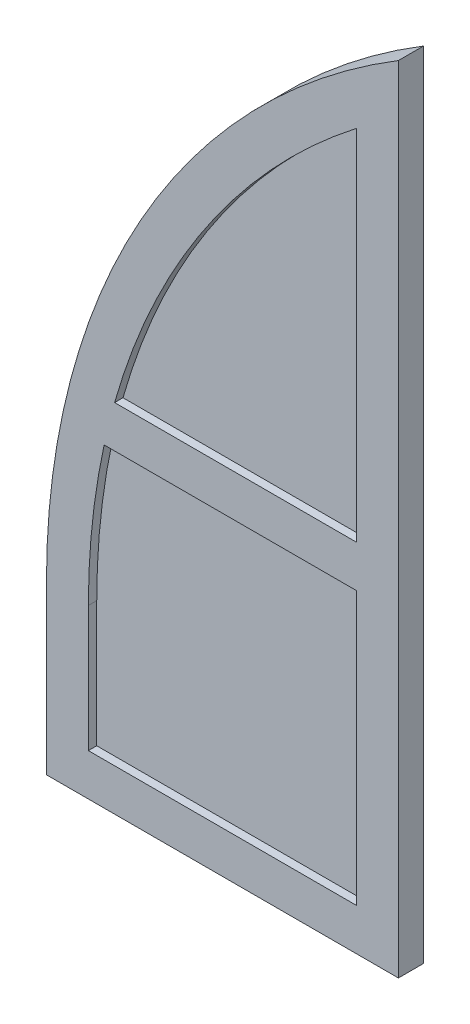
ISO-10303-21;
HEADER;
FILE_DESCRIPTION(('STEP AP214'),'2;1');
FILE_NAME('part.step','',(''),(''),'','','');
FILE_SCHEMA(('AUTOMOTIVE_DESIGN { 1 0 10303 214 1 1 1 1 }'));
ENDSEC;
DATA;
#1=APPLICATION_CONTEXT('core data for automotive mechanical design processes');
#2=APPLICATION_PROTOCOL_DEFINITION('international standard','automotive_design',2000,#1);
#3=PRODUCT_CONTEXT('',#1,'mechanical');
#4=PRODUCT('Part','Part','',(#3));
#5=PRODUCT_RELATED_PRODUCT_CATEGORY('part','',(#4));
#6=PRODUCT_DEFINITION_FORMATION('','',#4);
#7=PRODUCT_DEFINITION_CONTEXT('part definition',#1,'design');
#8=PRODUCT_DEFINITION('design','',#6,#7);
#9=PRODUCT_DEFINITION_SHAPE('','',#8);
#10=(LENGTH_UNIT() NAMED_UNIT(*) SI_UNIT(.MILLI.,.METRE.));
#11=(NAMED_UNIT(*) PLANE_ANGLE_UNIT() SI_UNIT($,.RADIAN.));
#12=(NAMED_UNIT(*) SI_UNIT($,.STERADIAN.) SOLID_ANGLE_UNIT());
#13=UNCERTAINTY_MEASURE_WITH_UNIT(LENGTH_MEASURE(1.E-05),#10,'distance_accuracy_value','');
#14=(GEOMETRIC_REPRESENTATION_CONTEXT(3) GLOBAL_UNCERTAINTY_ASSIGNED_CONTEXT((#13)) GLOBAL_UNIT_ASSIGNED_CONTEXT((#10,
#11,#12)) REPRESENTATION_CONTEXT('',''));
#15=CARTESIAN_POINT('',(0.,0.,0.));
#16=DIRECTION('',(0.,0.,1.));
#17=DIRECTION('',(1.,0.,0.));
#18=AXIS2_PLACEMENT_3D('',#15,#16,#17);
#19=CARTESIAN_POINT('',(1348.58140528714,-601.868682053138,10.));
#20=DIRECTION('',(0.,0.,-1.));
#21=DIRECTION('',(-1.,0.,0.));
#22=AXIS2_PLACEMENT_3D('',#19,#20,#21);
#23=CYLINDRICAL_SURFACE('',#22,1653.03652149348);
#24=DIRECTION('',(0.,0.,-1.));
#25=VECTOR('',#24,1.);
#26=CARTESIAN_POINT('',(-265.607331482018,-245.604084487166,10.));
#27=LINE('',#26,#25);
#28=CARTESIAN_POINT('',(-265.607331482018,-245.604084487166,10.));
#29=VERTEX_POINT('',#28);
#30=CARTESIAN_POINT('',(-265.607331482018,-245.604084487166,0.));
#31=VERTEX_POINT('',#30);
#32=EDGE_CURVE('E174',#29,#31,#27,.T.);
#33=ORIENTED_EDGE('',*,*,#32,.F.);
#34=CARTESIAN_POINT('',(1348.58140528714,-601.868682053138,10.));
#35=DIRECTION('',(0.,0.,-1.));
#36=DIRECTION('',(-1.,0.,0.));
#37=AXIS2_PLACEMENT_3D('',#34,#35,#36);
#38=CIRCLE('',#37,1653.03652149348);
#39=CARTESIAN_POINT('',(-304.455116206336,-601.868682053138,10.));
#40=VERTEX_POINT('',#39);
#41=EDGE_CURVE('E418',#40,#29,#38,.T.);
#42=ORIENTED_EDGE('',*,*,#41,.F.);
#43=DIRECTION('',(0.,0.,-1.));
#44=VECTOR('',#43,1.);
#45=CARTESIAN_POINT('',(-304.455116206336,-601.868682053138,10.));
#46=LINE('',#45,#44);
#47=CARTESIAN_POINT('',(-304.455116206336,-601.868682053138,0.));
#48=VERTEX_POINT('',#47);
#49=EDGE_CURVE('E208',#40,#48,#46,.T.);
#50=ORIENTED_EDGE('',*,*,#49,.T.);
#51=CARTESIAN_POINT('',(1348.58140528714,-601.868682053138,0.));
#52=DIRECTION('',(0.,0.,-1.));
#53=DIRECTION('',(-1.,0.,0.));
#54=AXIS2_PLACEMENT_3D('',#51,#52,#53);
#55=CIRCLE('',#54,1653.03652149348);
#56=EDGE_CURVE('E197',#48,#31,#55,.T.);
#57=ORIENTED_EDGE('',*,*,#56,.T.);
#58=EDGE_LOOP('',(#33,#42,#50,#57));
#59=FACE_BOUND('',#58,.T.);
#60=ADVANCED_FACE('F32',(#59),#23,.F.);
#61=DIRECTION('',(0.,0.,-1.));
#62=VECTOR('',#61,1.);
#63=CARTESIAN_POINT('',(-240.239653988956,-145.604084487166,10.));
#64=LINE('',#63,#62);
#65=CARTESIAN_POINT('',(-240.239653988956,-145.604084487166,0.));
#66=VERTEX_POINT('',#65);
#67=CARTESIAN_POINT('',(-240.239653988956,-145.604084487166,10.));
#68=VERTEX_POINT('',#67);
#69=EDGE_CURVE('E47',#66,#68,#64,.F.);
#70=ORIENTED_EDGE('',*,*,#69,.F.);
#71=CARTESIAN_POINT('',(335.544883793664,704.38043182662,0.));
#72=VERTEX_POINT('',#71);
#73=EDGE_CURVE('E53',#66,#72,#55,.T.);
#74=ORIENTED_EDGE('',*,*,#73,.T.);
#75=DIRECTION('',(0.,0.,-1.));
#76=VECTOR('',#75,1.);
#77=CARTESIAN_POINT('',(335.544883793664,704.38043182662,10.));
#78=LINE('',#77,#76);
#79=CARTESIAN_POINT('',(335.544883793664,704.38043182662,10.));
#80=VERTEX_POINT('',#79);
#81=EDGE_CURVE('E215',#80,#72,#78,.T.);
#82=ORIENTED_EDGE('',*,*,#81,.F.);
#83=EDGE_CURVE('E207',#68,#80,#38,.T.);
#84=ORIENTED_EDGE('',*,*,#83,.F.);
#85=EDGE_LOOP('',(#70,#74,#82,#84));
#86=FACE_BOUND('',#85,.T.);
#87=ADVANCED_FACE('F338',(#86),#23,.F.);
#88=CARTESIAN_POINT('',(335.544883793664,704.38043182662,10.));
#89=DIRECTION('',(1.,0.,0.));
#90=DIRECTION('',(0.,0.,-1.));
#91=AXIS2_PLACEMENT_3D('',#88,#89,#90);
#92=PLANE('',#91);
#93=DIRECTION('',(0.,0.,1.));
#94=VECTOR('',#93,1.);
#95=CARTESIAN_POINT('',(335.544883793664,-245.604084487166,0.));
#96=LINE('',#95,#94);
#97=CARTESIAN_POINT('',(335.544883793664,-245.604084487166,0.));
#98=VERTEX_POINT('',#97);
#99=CARTESIAN_POINT('',(335.544883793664,-245.604084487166,10.));
#100=VERTEX_POINT('',#99);
#101=EDGE_CURVE('E171',#98,#100,#96,.T.);
#102=ORIENTED_EDGE('',*,*,#101,.F.);
#103=DIRECTION('',(0.,-1.,0.));
#104=VECTOR('',#103,1.);
#105=CARTESIAN_POINT('',(335.544883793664,704.38043182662,0.));
#106=LINE('',#105,#104);
#107=CARTESIAN_POINT('',(335.544883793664,-901.868682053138,0.));
#108=VERTEX_POINT('',#107);
#109=EDGE_CURVE('E186',#98,#108,#106,.T.);
#110=ORIENTED_EDGE('',*,*,#109,.T.);
#111=DIRECTION('',(0.,0.,-1.));
#112=VECTOR('',#111,1.);
#113=CARTESIAN_POINT('',(335.544883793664,-901.868682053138,10.));
#114=LINE('',#113,#112);
#115=CARTESIAN_POINT('',(335.544883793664,-901.868682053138,10.));
#116=VERTEX_POINT('',#115);
#117=EDGE_CURVE('E213',#116,#108,#114,.T.);
#118=ORIENTED_EDGE('',*,*,#117,.F.);
#119=DIRECTION('',(0.,-1.,0.));
#120=VECTOR('',#119,1.);
#121=CARTESIAN_POINT('',(335.544883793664,704.38043182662,10.));
#122=LINE('',#121,#120);
#123=EDGE_CURVE('E188',#100,#116,#122,.T.);
#124=ORIENTED_EDGE('',*,*,#123,.F.);
#125=EDGE_LOOP('',(#102,#110,#118,#124));
#126=FACE_BOUND('',#125,.T.);
#127=ADVANCED_FACE('F184',(#126),#92,.F.);
#128=DIRECTION('',(0.,0.,1.));
#129=VECTOR('',#128,1.);
#130=CARTESIAN_POINT('',(335.544883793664,-145.604084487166,0.));
#131=LINE('',#130,#129);
#132=CARTESIAN_POINT('',(335.544883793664,-145.604084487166,0.));
#133=VERTEX_POINT('',#132);
#134=CARTESIAN_POINT('',(335.544883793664,-145.604084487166,10.));
#135=VERTEX_POINT('',#134);
#136=EDGE_CURVE('E189',#133,#135,#131,.T.);
#137=ORIENTED_EDGE('',*,*,#136,.T.);
#138=EDGE_CURVE('E414',#80,#135,#122,.T.);
#139=ORIENTED_EDGE('',*,*,#138,.F.);
#140=ORIENTED_EDGE('',*,*,#81,.T.);
#141=EDGE_CURVE('E196',#72,#133,#106,.T.);
#142=ORIENTED_EDGE('',*,*,#141,.T.);
#143=EDGE_LOOP('',(#137,#139,#140,#142));
#144=FACE_BOUND('',#143,.T.);
#145=ADVANCED_FACE('F392',(#144),#92,.F.);
#146=CARTESIAN_POINT('',(1348.58140528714,-601.868682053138,10.));
#147=DIRECTION('',(0.,0.,-1.));
#148=DIRECTION('',(-1.,0.,0.));
#149=AXIS2_PLACEMENT_3D('',#146,#147,#148);
#150=PLANE('',#149);
#151=ORIENTED_EDGE('',*,*,#41,.T.);
#152=DIRECTION('',(-1.,0.,0.));
#153=VECTOR('',#152,1.);
#154=CARTESIAN_POINT('',(335.544883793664,-245.604084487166,10.));
#155=LINE('',#154,#153);
#156=EDGE_CURVE('E180',#100,#29,#155,.T.);
#157=ORIENTED_EDGE('',*,*,#156,.F.);
#158=ORIENTED_EDGE('',*,*,#123,.T.);
#159=DIRECTION('',(-1.,0.,0.));
#160=VECTOR('',#159,1.);
#161=CARTESIAN_POINT('',(335.544883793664,-901.868682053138,10.));
#162=LINE('',#161,#160);
#163=CARTESIAN_POINT('',(-304.455116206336,-901.868682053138,10.));
#164=VERTEX_POINT('',#163);
#165=EDGE_CURVE('E413',#116,#164,#162,.T.);
#166=ORIENTED_EDGE('',*,*,#165,.T.);
#167=DIRECTION('',(0.,1.,0.));
#168=VECTOR('',#167,1.);
#169=CARTESIAN_POINT('',(-304.455116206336,-901.868682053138,10.));
#170=LINE('',#169,#168);
#171=EDGE_CURVE('E217',#164,#40,#170,.T.);
#172=ORIENTED_EDGE('',*,*,#171,.T.);
#173=EDGE_LOOP('',(#151,#157,#158,#166,#172));
#174=FACE_BOUND('',#173,.T.);
#175=ADVANCED_FACE('F386',(#174),#150,.T.);
#176=ORIENTED_EDGE('',*,*,#138,.T.);
#177=DIRECTION('',(-1.,0.,0.));
#178=VECTOR('',#177,1.);
#179=CARTESIAN_POINT('',(1348.58140528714,-145.604084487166,10.));
#180=LINE('',#179,#178);
#181=EDGE_CURVE('E11',#135,#68,#180,.T.);
#182=ORIENTED_EDGE('',*,*,#181,.T.);
#183=ORIENTED_EDGE('',*,*,#83,.T.);
#184=EDGE_LOOP('',(#176,#182,#183));
#185=FACE_BOUND('',#184,.T.);
#186=ADVANCED_FACE('F382',(#185),#150,.T.);
#187=CARTESIAN_POINT('',(0.,0.,40.));
#188=DIRECTION('',(0.,0.,1.));
#189=DIRECTION('',(1.,0.,0.));
#190=AXIS2_PLACEMENT_3D('',#187,#188,#189);
#191=PLANE('',#190);
#192=CARTESIAN_POINT('',(1348.58140528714,-601.868682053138,40.));
#193=DIRECTION('',(0.,0.,1.));
#194=DIRECTION('',(1.,0.,0.));
#195=AXIS2_PLACEMENT_3D('',#192,#193,#194);
#196=CIRCLE('',#195,1653.03652149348);
#197=CARTESIAN_POINT('',(-241.815699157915,-151.128411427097,40.));
#198=VERTEX_POINT('',#197);
#199=CARTESIAN_POINT('',(335.544883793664,704.38043182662,40.));
#200=VERTEX_POINT('',#199);
#201=EDGE_CURVE('E283',#198,#200,#196,.F.);
#202=ORIENTED_EDGE('',*,*,#201,.F.);
#203=DIRECTION('',(-1.,0.,0.));
#204=VECTOR('',#203,1.);
#205=CARTESIAN_POINT('',(0.,-151.128411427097,40.));
#206=LINE('',#205,#204);
#207=CARTESIAN_POINT('',(335.544883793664,-151.128411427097,40.));
#208=VERTEX_POINT('',#207);
#209=EDGE_CURVE('E307',#208,#198,#206,.T.);
#210=ORIENTED_EDGE('',*,*,#209,.F.);
#211=DIRECTION('',(0.,1.,0.));
#212=VECTOR('',#211,1.);
#213=CARTESIAN_POINT('',(335.544883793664,0.,40.));
#214=LINE('',#213,#212);
#215=EDGE_CURVE('E40',#208,#200,#214,.T.);
#216=ORIENTED_EDGE('',*,*,#215,.T.);
#217=EDGE_LOOP('',(#202,#210,#216));
#218=FACE_BOUND('',#217,.T.);
#219=ADVANCED_FACE('F312',(#218),#191,.T.);
#220=CARTESIAN_POINT('',(0.,-151.128411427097,60.));
#221=DIRECTION('',(0.,-1.,0.));
#222=DIRECTION('',(0.,0.,-1.));
#223=AXIS2_PLACEMENT_3D('',#220,#221,#222);
#224=PLANE('',#223);
#225=ORIENTED_EDGE('',*,*,#209,.T.);
#226=DIRECTION('',(0.,0.,-1.));
#227=VECTOR('',#226,1.);
#228=CARTESIAN_POINT('',(-241.815699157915,-151.128411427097,60.));
#229=LINE('',#228,#227);
#230=CARTESIAN_POINT('',(-241.815699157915,-151.128411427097,60.));
#231=VERTEX_POINT('',#230);
#232=EDGE_CURVE('E280',#231,#198,#229,.T.);
#233=ORIENTED_EDGE('',*,*,#232,.F.);
#234=DIRECTION('',(-1.,0.,0.));
#235=VECTOR('',#234,1.);
#236=CARTESIAN_POINT('',(0.,-151.128411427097,60.));
#237=LINE('',#236,#235);
#238=CARTESIAN_POINT('',(335.544883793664,-151.128411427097,60.));
#239=VERTEX_POINT('',#238);
#240=EDGE_CURVE('E256',#239,#231,#237,.T.);
#241=ORIENTED_EDGE('',*,*,#240,.F.);
#242=DIRECTION('',(0.,0.,-1.));
#243=VECTOR('',#242,1.);
#244=CARTESIAN_POINT('',(335.544883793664,-151.128411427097,60.));
#245=LINE('',#244,#243);
#246=EDGE_CURVE('E274',#239,#208,#245,.T.);
#247=ORIENTED_EDGE('',*,*,#246,.T.);
#248=EDGE_LOOP('',(#225,#233,#241,#247));
#249=FACE_BOUND('',#248,.T.);
#250=ADVANCED_FACE('F318',(#249),#224,.F.);
#251=CARTESIAN_POINT('',(1348.58140528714,-601.868682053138,60.));
#252=DIRECTION('',(0.,0.,-1.));
#253=DIRECTION('',(-1.,0.,0.));
#254=AXIS2_PLACEMENT_3D('',#251,#252,#253);
#255=CYLINDRICAL_SURFACE('',#254,1653.03652149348);
#256=ORIENTED_EDGE('',*,*,#201,.T.);
#257=DIRECTION('',(0.,0.,-1.));
#258=VECTOR('',#257,1.);
#259=CARTESIAN_POINT('',(335.544883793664,704.38043182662,60.));
#260=LINE('',#259,#258);
#261=CARTESIAN_POINT('',(335.544883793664,704.38043182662,60.));
#262=VERTEX_POINT('',#261);
#263=EDGE_CURVE('E277',#262,#200,#260,.T.);
#264=ORIENTED_EDGE('',*,*,#263,.F.);
#265=CARTESIAN_POINT('',(1348.58140528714,-601.868682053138,60.));
#266=DIRECTION('',(0.,0.,1.));
#267=DIRECTION('',(1.,0.,0.));
#268=AXIS2_PLACEMENT_3D('',#265,#266,#267);
#269=CIRCLE('',#268,1653.03652149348);
#270=EDGE_CURVE('E259',#231,#262,#269,.F.);
#271=ORIENTED_EDGE('',*,*,#270,.F.);
#272=ORIENTED_EDGE('',*,*,#232,.T.);
#273=EDGE_LOOP('',(#256,#264,#271,#272));
#274=FACE_BOUND('',#273,.T.);
#275=ADVANCED_FACE('F324',(#274),#255,.F.);
#276=CARTESIAN_POINT('',(-304.455116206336,0.,60.));
#277=DIRECTION('',(-1.,0.,0.));
#278=DIRECTION('',(0.,0.,1.));
#279=AXIS2_PLACEMENT_3D('',#276,#277,#278);
#280=PLANE('',#279);
#281=DIRECTION('',(0.,0.,-1.));
#282=VECTOR('',#281,1.);
#283=CARTESIAN_POINT('',(-304.455116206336,-901.868682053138,60.));
#284=LINE('',#283,#282);
#285=CARTESIAN_POINT('',(-304.455116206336,-901.868682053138,60.));
#286=VERTEX_POINT('',#285);
#287=CARTESIAN_POINT('',(-304.455116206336,-901.868682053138,40.));
#288=VERTEX_POINT('',#287);
#289=EDGE_CURVE('E284',#286,#288,#284,.T.);
#290=ORIENTED_EDGE('',*,*,#289,.T.);
#291=DIRECTION('',(0.,1.,0.));
#292=VECTOR('',#291,1.);
#293=CARTESIAN_POINT('',(-304.455116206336,0.,40.));
#294=LINE('',#293,#292);
#295=CARTESIAN_POINT('',(-304.455116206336,-601.868682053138,40.));
#296=VERTEX_POINT('',#295);
#297=EDGE_CURVE('E219',#288,#296,#294,.T.);
#298=ORIENTED_EDGE('',*,*,#297,.T.);
#299=DIRECTION('',(0.,0.,-1.));
#300=VECTOR('',#299,1.);
#301=CARTESIAN_POINT('',(-304.455116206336,-601.868682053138,60.));
#302=LINE('',#301,#300);
#303=CARTESIAN_POINT('',(-304.455116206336,-601.868682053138,60.));
#304=VERTEX_POINT('',#303);
#305=EDGE_CURVE('E278',#304,#296,#302,.T.);
#306=ORIENTED_EDGE('',*,*,#305,.F.);
#307=DIRECTION('',(0.,1.,0.));
#308=VECTOR('',#307,1.);
#309=CARTESIAN_POINT('',(-304.455116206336,0.,60.));
#310=LINE('',#309,#308);
#311=EDGE_CURVE('E242',#286,#304,#310,.T.);
#312=ORIENTED_EDGE('',*,*,#311,.F.);
#313=EDGE_LOOP('',(#290,#298,#306,#312));
#314=FACE_BOUND('',#313,.T.);
#315=ADVANCED_FACE('F326',(#314),#280,.F.);
#316=CARTESIAN_POINT('',(1348.58140528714,-601.868682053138,60.));
#317=DIRECTION('',(0.,0.,-1.));
#318=DIRECTION('',(-1.,0.,0.));
#319=AXIS2_PLACEMENT_3D('',#316,#317,#318);
#320=CYLINDRICAL_SURFACE('',#319,1653.03652149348);
#321=ORIENTED_EDGE('',*,*,#305,.T.);
#322=CARTESIAN_POINT('',(1348.58140528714,-601.868682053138,40.));
#323=DIRECTION('',(0.,0.,1.));
#324=DIRECTION('',(1.,0.,0.));
#325=AXIS2_PLACEMENT_3D('',#322,#323,#324);
#326=CIRCLE('',#325,1653.03652149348);
#327=CARTESIAN_POINT('',(-266.816689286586,-251.128411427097,40.));
#328=VERTEX_POINT('',#327);
#329=EDGE_CURVE('E210',#296,#328,#326,.F.);
#330=ORIENTED_EDGE('',*,*,#329,.T.);
#331=DIRECTION('',(0.,0.,-1.));
#332=VECTOR('',#331,1.);
#333=CARTESIAN_POINT('',(-266.816689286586,-251.128411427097,60.));
#334=LINE('',#333,#332);
#335=CARTESIAN_POINT('',(-266.816689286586,-251.128411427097,60.));
#336=VERTEX_POINT('',#335);
#337=EDGE_CURVE('E293',#336,#328,#334,.T.);
#338=ORIENTED_EDGE('',*,*,#337,.F.);
#339=CARTESIAN_POINT('',(1348.58140528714,-601.868682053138,60.));
#340=DIRECTION('',(0.,0.,1.));
#341=DIRECTION('',(1.,0.,0.));
#342=AXIS2_PLACEMENT_3D('',#339,#340,#341);
#343=CIRCLE('',#342,1653.03652149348);
#344=EDGE_CURVE('E245',#304,#336,#343,.F.);
#345=ORIENTED_EDGE('',*,*,#344,.F.);
#346=EDGE_LOOP('',(#321,#330,#338,#345));
#347=FACE_BOUND('',#346,.T.);
#348=ADVANCED_FACE('F332',(#347),#320,.F.);
#349=CARTESIAN_POINT('',(0.,-251.128411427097,60.));
#350=DIRECTION('',(0.,-1.,0.));
#351=DIRECTION('',(1.,0.,0.));
#352=AXIS2_PLACEMENT_3D('',#349,#350,#351);
#353=PLANE('',#352);
#354=DIRECTION('',(-1.,0.,0.));
#355=VECTOR('',#354,1.);
#356=CARTESIAN_POINT('',(0.,-251.128411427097,40.));
#357=LINE('',#356,#355);
#358=CARTESIAN_POINT('',(335.544883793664,-251.128411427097,40.));
#359=VERTEX_POINT('',#358);
#360=EDGE_CURVE('E227',#359,#328,#357,.T.);
#361=ORIENTED_EDGE('',*,*,#360,.F.);
#362=DIRECTION('',(0.,0.,-1.));
#363=VECTOR('',#362,1.);
#364=CARTESIAN_POINT('',(335.544883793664,-251.128411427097,60.));
#365=LINE('',#364,#363);
#366=CARTESIAN_POINT('',(335.544883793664,-251.128411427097,60.));
#367=VERTEX_POINT('',#366);
#368=EDGE_CURVE('E290',#367,#359,#365,.T.);
#369=ORIENTED_EDGE('',*,*,#368,.F.);
#370=DIRECTION('',(-1.,0.,0.));
#371=VECTOR('',#370,1.);
#372=CARTESIAN_POINT('',(0.,-251.128411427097,60.));
#373=LINE('',#372,#371);
#374=EDGE_CURVE('E247',#367,#336,#373,.T.);
#375=ORIENTED_EDGE('',*,*,#374,.T.);
#376=ORIENTED_EDGE('',*,*,#337,.T.);
#377=EDGE_LOOP('',(#361,#369,#375,#376));
#378=FACE_BOUND('',#377,.T.);
#379=ADVANCED_FACE('F514',(#378),#353,.T.);
#380=CARTESIAN_POINT('',(335.544883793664,0.,60.));
#381=DIRECTION('',(-1.,0.,0.));
#382=DIRECTION('',(0.,-1.,0.));
#383=AXIS2_PLACEMENT_3D('',#380,#381,#382);
#384=PLANE('',#383);
#385=DIRECTION('',(0.,1.,0.));
#386=VECTOR('',#385,1.);
#387=CARTESIAN_POINT('',(335.544883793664,0.,40.));
#388=LINE('',#387,#386);
#389=CARTESIAN_POINT('',(335.544883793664,-901.868682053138,40.));
#390=VERTEX_POINT('',#389);
#391=EDGE_CURVE('E224',#390,#359,#388,.T.);
#392=ORIENTED_EDGE('',*,*,#391,.F.);
#393=DIRECTION('',(0.,0.,-1.));
#394=VECTOR('',#393,1.);
#395=CARTESIAN_POINT('',(335.544883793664,-901.868682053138,60.));
#396=LINE('',#395,#394);
#397=CARTESIAN_POINT('',(335.544883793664,-901.868682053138,60.));
#398=VERTEX_POINT('',#397);
#399=EDGE_CURVE('E287',#398,#390,#396,.T.);
#400=ORIENTED_EDGE('',*,*,#399,.F.);
#401=DIRECTION('',(0.,1.,0.));
#402=VECTOR('',#401,1.);
#403=CARTESIAN_POINT('',(335.544883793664,0.,60.));
#404=LINE('',#403,#402);
#405=EDGE_CURVE('E250',#398,#367,#404,.T.);
#406=ORIENTED_EDGE('',*,*,#405,.T.);
#407=ORIENTED_EDGE('',*,*,#368,.T.);
#408=EDGE_LOOP('',(#392,#400,#406,#407));
#409=FACE_BOUND('',#408,.T.);
#410=ADVANCED_FACE('F379',(#409),#384,.T.);
#411=CARTESIAN_POINT('',(1348.58140528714,-601.868682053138,60.));
#412=DIRECTION('',(0.,0.,-1.));
#413=DIRECTION('',(-1.,0.,0.));
#414=AXIS2_PLACEMENT_3D('',#411,#412,#413);
#415=CYLINDRICAL_SURFACE('',#414,1753.03652149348);
#416=CARTESIAN_POINT('',(1348.58140528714,-601.868682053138,0.));
#417=DIRECTION('',(0.,0.,1.));
#418=DIRECTION('',(1.,0.,0.));
#419=AXIS2_PLACEMENT_3D('',#416,#417,#418);
#420=CIRCLE('',#419,1753.03652149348);
#421=CARTESIAN_POINT('',(-404.455116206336,-601.868682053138,0.));
#422=VERTEX_POINT('',#421);
#423=CARTESIAN_POINT('',(435.544883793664,894.627678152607,0.));
#424=VERTEX_POINT('',#423);
#425=EDGE_CURVE('E230',#422,#424,#420,.F.);
#426=ORIENTED_EDGE('',*,*,#425,.F.);
#427=DIRECTION('',(0.,0.,-1.));
#428=VECTOR('',#427,1.);
#429=CARTESIAN_POINT('',(-404.455116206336,-601.868682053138,60.));
#430=LINE('',#429,#428);
#431=CARTESIAN_POINT('',(-404.455116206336,-601.868682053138,60.));
#432=VERTEX_POINT('',#431);
#433=EDGE_CURVE('E288',#432,#422,#430,.T.);
#434=ORIENTED_EDGE('',*,*,#433,.F.);
#435=CARTESIAN_POINT('',(1348.58140528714,-601.868682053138,60.));
#436=DIRECTION('',(0.,0.,1.));
#437=DIRECTION('',(1.,0.,0.));
#438=AXIS2_PLACEMENT_3D('',#435,#436,#437);
#439=CIRCLE('',#438,1753.03652149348);
#440=CARTESIAN_POINT('',(435.544883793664,894.627678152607,60.));
#441=VERTEX_POINT('',#440);
#442=EDGE_CURVE('E231',#432,#441,#439,.F.);
#443=ORIENTED_EDGE('',*,*,#442,.T.);
#444=DIRECTION('',(0.,0.,-1.));
#445=VECTOR('',#444,1.);
#446=CARTESIAN_POINT('',(435.544883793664,894.627678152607,60.));
#447=LINE('',#446,#445);
#448=EDGE_CURVE('E264',#441,#424,#447,.T.);
#449=ORIENTED_EDGE('',*,*,#448,.T.);
#450=EDGE_LOOP('',(#426,#434,#443,#449));
#451=FACE_BOUND('',#450,.T.);
#452=ADVANCED_FACE('F376',(#451),#415,.T.);
#453=CARTESIAN_POINT('',(-404.455116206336,0.,60.));
#454=DIRECTION('',(-1.,0.,0.));
#455=DIRECTION('',(0.,0.,1.));
#456=AXIS2_PLACEMENT_3D('',#453,#454,#455);
#457=PLANE('',#456);
#458=DIRECTION('',(0.,1.,0.));
#459=VECTOR('',#458,1.);
#460=CARTESIAN_POINT('',(-404.455116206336,0.,0.));
#461=LINE('',#460,#459);
#462=CARTESIAN_POINT('',(-404.455116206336,-1001.86868205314,0.));
#463=VERTEX_POINT('',#462);
#464=EDGE_CURVE('E267',#463,#422,#461,.T.);
#465=ORIENTED_EDGE('',*,*,#464,.F.);
#466=DIRECTION('',(0.,0.,-1.));
#467=VECTOR('',#466,1.);
#468=CARTESIAN_POINT('',(-404.455116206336,-1001.86868205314,60.));
#469=LINE('',#468,#467);
#470=CARTESIAN_POINT('',(-404.455116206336,-1001.86868205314,60.));
#471=VERTEX_POINT('',#470);
#472=EDGE_CURVE('E302',#471,#463,#469,.T.);
#473=ORIENTED_EDGE('',*,*,#472,.F.);
#474=DIRECTION('',(0.,1.,0.));
#475=VECTOR('',#474,1.);
#476=CARTESIAN_POINT('',(-404.455116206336,0.,60.));
#477=LINE('',#476,#475);
#478=EDGE_CURVE('E234',#471,#432,#477,.T.);
#479=ORIENTED_EDGE('',*,*,#478,.T.);
#480=ORIENTED_EDGE('',*,*,#433,.T.);
#481=EDGE_LOOP('',(#465,#473,#479,#480));
#482=FACE_BOUND('',#481,.T.);
#483=ADVANCED_FACE('F372',(#482),#457,.T.);
#484=CARTESIAN_POINT('',(0.,-1001.86868205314,60.));
#485=DIRECTION('',(0.,1.,0.));
#486=DIRECTION('',(0.,0.,1.));
#487=AXIS2_PLACEMENT_3D('',#484,#485,#486);
#488=PLANE('',#487);
#489=DIRECTION('',(1.,0.,0.));
#490=VECTOR('',#489,1.);
#491=CARTESIAN_POINT('',(0.,-1001.86868205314,0.));
#492=LINE('',#491,#490);
#493=CARTESIAN_POINT('',(435.544883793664,-1001.86868205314,0.));
#494=VERTEX_POINT('',#493);
#495=EDGE_CURVE('E270',#463,#494,#492,.T.);
#496=ORIENTED_EDGE('',*,*,#495,.T.);
#497=DIRECTION('',(0.,0.,-1.));
#498=VECTOR('',#497,1.);
#499=CARTESIAN_POINT('',(435.544883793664,-1001.86868205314,60.));
#500=LINE('',#499,#498);
#501=CARTESIAN_POINT('',(435.544883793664,-1001.86868205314,60.));
#502=VERTEX_POINT('',#501);
#503=EDGE_CURVE('E299',#502,#494,#500,.T.);
#504=ORIENTED_EDGE('',*,*,#503,.F.);
#505=DIRECTION('',(1.,0.,0.));
#506=VECTOR('',#505,1.);
#507=CARTESIAN_POINT('',(0.,-1001.86868205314,60.));
#508=LINE('',#507,#506);
#509=EDGE_CURVE('E238',#471,#502,#508,.T.);
#510=ORIENTED_EDGE('',*,*,#509,.F.);
#511=ORIENTED_EDGE('',*,*,#472,.T.);
#512=EDGE_LOOP('',(#496,#504,#510,#511));
#513=FACE_BOUND('',#512,.T.);
#514=ADVANCED_FACE('F365',(#513),#488,.F.);
#515=CARTESIAN_POINT('',(0.,-901.868682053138,60.));
#516=DIRECTION('',(0.,1.,0.));
#517=DIRECTION('',(0.,0.,1.));
#518=AXIS2_PLACEMENT_3D('',#515,#516,#517);
#519=PLANE('',#518);
#520=DIRECTION('',(1.,0.,0.));
#521=VECTOR('',#520,1.);
#522=CARTESIAN_POINT('',(0.,-901.868682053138,40.));
#523=LINE('',#522,#521);
#524=EDGE_CURVE('E221',#288,#390,#523,.T.);
#525=ORIENTED_EDGE('',*,*,#524,.F.);
#526=ORIENTED_EDGE('',*,*,#289,.F.);
#527=DIRECTION('',(1.,0.,0.));
#528=VECTOR('',#527,1.);
#529=CARTESIAN_POINT('',(0.,-901.868682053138,60.));
#530=LINE('',#529,#528);
#531=EDGE_CURVE('E253',#286,#398,#530,.T.);
#532=ORIENTED_EDGE('',*,*,#531,.T.);
#533=ORIENTED_EDGE('',*,*,#399,.T.);
#534=EDGE_LOOP('',(#525,#526,#532,#533));
#535=FACE_BOUND('',#534,.T.);
#536=ADVANCED_FACE('F359',(#535),#519,.T.);
#537=CARTESIAN_POINT('',(435.544883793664,0.,60.));
#538=DIRECTION('',(-1.,0.,0.));
#539=DIRECTION('',(0.,0.,1.));
#540=AXIS2_PLACEMENT_3D('',#537,#538,#539);
#541=PLANE('',#540);
#542=DIRECTION('',(0.,1.,0.));
#543=VECTOR('',#542,1.);
#544=CARTESIAN_POINT('',(435.544883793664,0.,0.));
#545=LINE('',#544,#543);
#546=EDGE_CURVE('E235',#494,#424,#545,.T.);
#547=ORIENTED_EDGE('',*,*,#546,.T.);
#548=ORIENTED_EDGE('',*,*,#448,.F.);
#549=DIRECTION('',(0.,1.,0.));
#550=VECTOR('',#549,1.);
#551=CARTESIAN_POINT('',(435.544883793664,0.,60.));
#552=LINE('',#551,#550);
#553=EDGE_CURVE('E240',#502,#441,#552,.T.);
#554=ORIENTED_EDGE('',*,*,#553,.F.);
#555=ORIENTED_EDGE('',*,*,#503,.T.);
#556=EDGE_LOOP('',(#547,#548,#554,#555));
#557=FACE_BOUND('',#556,.T.);
#558=ADVANCED_FACE('F355',(#557),#541,.F.);
#559=CARTESIAN_POINT('',(335.544883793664,0.,60.));
#560=DIRECTION('',(-1.,0.,0.));
#561=DIRECTION('',(0.,-1.,0.));
#562=AXIS2_PLACEMENT_3D('',#559,#560,#561);
#563=PLANE('',#562);
#564=ORIENTED_EDGE('',*,*,#263,.T.);
#565=ORIENTED_EDGE('',*,*,#215,.F.);
#566=ORIENTED_EDGE('',*,*,#246,.F.);
#567=DIRECTION('',(0.,1.,0.));
#568=VECTOR('',#567,1.);
#569=CARTESIAN_POINT('',(335.544883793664,0.,60.));
#570=LINE('',#569,#568);
#571=EDGE_CURVE('E261',#239,#262,#570,.T.);
#572=ORIENTED_EDGE('',*,*,#571,.T.);
#573=EDGE_LOOP('',(#564,#565,#566,#572));
#574=FACE_BOUND('',#573,.T.);
#575=ADVANCED_FACE('F314',(#574),#563,.T.);
#576=CARTESIAN_POINT('',(0.,0.,60.));
#577=DIRECTION('',(0.,0.,1.));
#578=DIRECTION('',(1.,0.,0.));
#579=AXIS2_PLACEMENT_3D('',#576,#577,#578);
#580=PLANE('',#579);
#581=ORIENTED_EDGE('',*,*,#442,.F.);
#582=ORIENTED_EDGE('',*,*,#478,.F.);
#583=ORIENTED_EDGE('',*,*,#509,.T.);
#584=ORIENTED_EDGE('',*,*,#553,.T.);
#585=EDGE_LOOP('',(#581,#582,#583,#584));
#586=FACE_BOUND('',#585,.T.);
#587=ORIENTED_EDGE('',*,*,#311,.T.);
#588=ORIENTED_EDGE('',*,*,#344,.T.);
#589=ORIENTED_EDGE('',*,*,#374,.F.);
#590=ORIENTED_EDGE('',*,*,#405,.F.);
#591=ORIENTED_EDGE('',*,*,#531,.F.);
#592=EDGE_LOOP('',(#587,#588,#589,#590,#591));
#593=FACE_BOUND('',#592,.T.);
#594=ORIENTED_EDGE('',*,*,#240,.T.);
#595=ORIENTED_EDGE('',*,*,#270,.T.);
#596=ORIENTED_EDGE('',*,*,#571,.F.);
#597=EDGE_LOOP('',(#594,#595,#596));
#598=FACE_BOUND('',#597,.T.);
#599=ADVANCED_FACE('F322',(#586,#593,#598),#580,.T.);
#600=CARTESIAN_POINT('',(0.,0.,0.));
#601=DIRECTION('',(0.,0.,1.));
#602=DIRECTION('',(1.,0.,0.));
#603=AXIS2_PLACEMENT_3D('',#600,#601,#602);
#604=PLANE('',#603);
#605=ORIENTED_EDGE('',*,*,#73,.F.);
#606=DIRECTION('',(1.,0.,0.));
#607=VECTOR('',#606,1.);
#608=CARTESIAN_POINT('',(335.544883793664,-145.604084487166,0.));
#609=LINE('',#608,#607);
#610=EDGE_CURVE('E179',#66,#133,#609,.T.);
#611=ORIENTED_EDGE('',*,*,#610,.T.);
#612=ORIENTED_EDGE('',*,*,#141,.F.);
#613=EDGE_LOOP('',(#605,#611,#612));
#614=FACE_BOUND('',#613,.T.);
#615=DIRECTION('',(-1.,0.,0.));
#616=VECTOR('',#615,1.);
#617=CARTESIAN_POINT('',(335.544883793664,-245.604084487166,0.));
#618=LINE('',#617,#616);
#619=EDGE_CURVE('E168',#98,#31,#618,.T.);
#620=ORIENTED_EDGE('',*,*,#619,.T.);
#621=ORIENTED_EDGE('',*,*,#56,.F.);
#622=DIRECTION('',(0.,1.,0.));
#623=VECTOR('',#622,1.);
#624=CARTESIAN_POINT('',(-304.455116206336,-901.868682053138,0.));
#625=LINE('',#624,#623);
#626=CARTESIAN_POINT('',(-304.455116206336,-901.868682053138,0.));
#627=VERTEX_POINT('',#626);
#628=EDGE_CURVE('E204',#627,#48,#625,.T.);
#629=ORIENTED_EDGE('',*,*,#628,.F.);
#630=DIRECTION('',(-1.,0.,0.));
#631=VECTOR('',#630,1.);
#632=CARTESIAN_POINT('',(335.544883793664,-901.868682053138,0.));
#633=LINE('',#632,#631);
#634=EDGE_CURVE('E195',#108,#627,#633,.T.);
#635=ORIENTED_EDGE('',*,*,#634,.F.);
#636=ORIENTED_EDGE('',*,*,#109,.F.);
#637=EDGE_LOOP('',(#620,#621,#629,#635,#636));
#638=FACE_BOUND('',#637,.T.);
#639=ORIENTED_EDGE('',*,*,#425,.T.);
#640=ORIENTED_EDGE('',*,*,#546,.F.);
#641=ORIENTED_EDGE('',*,*,#495,.F.);
#642=ORIENTED_EDGE('',*,*,#464,.T.);
#643=EDGE_LOOP('',(#639,#640,#641,#642));
#644=FACE_BOUND('',#643,.T.);
#645=ADVANCED_FACE('F34',(#614,#638,#644),#604,.F.);
#646=CARTESIAN_POINT('',(0.,0.,40.));
#647=DIRECTION('',(0.,0.,1.));
#648=DIRECTION('',(1.,0.,0.));
#649=AXIS2_PLACEMENT_3D('',#646,#647,#648);
#650=PLANE('',#649);
#651=ORIENTED_EDGE('',*,*,#329,.F.);
#652=ORIENTED_EDGE('',*,*,#297,.F.);
#653=ORIENTED_EDGE('',*,*,#524,.T.);
#654=ORIENTED_EDGE('',*,*,#391,.T.);
#655=ORIENTED_EDGE('',*,*,#360,.T.);
#656=EDGE_LOOP('',(#651,#652,#653,#654,#655));
#657=FACE_BOUND('',#656,.T.);
#658=ADVANCED_FACE('F347',(#657),#650,.T.);
#659=CARTESIAN_POINT('',(-304.455116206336,-901.868682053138,10.));
#660=DIRECTION('',(-1.,0.,0.));
#661=DIRECTION('',(0.,0.,1.));
#662=AXIS2_PLACEMENT_3D('',#659,#660,#661);
#663=PLANE('',#662);
#664=ORIENTED_EDGE('',*,*,#628,.T.);
#665=ORIENTED_EDGE('',*,*,#49,.F.);
#666=ORIENTED_EDGE('',*,*,#171,.F.);
#667=DIRECTION('',(0.,0.,-1.));
#668=VECTOR('',#667,1.);
#669=CARTESIAN_POINT('',(-304.455116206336,-901.868682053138,10.));
#670=LINE('',#669,#668);
#671=EDGE_CURVE('E211',#164,#627,#670,.T.);
#672=ORIENTED_EDGE('',*,*,#671,.T.);
#673=EDGE_LOOP('',(#664,#665,#666,#672));
#674=FACE_BOUND('',#673,.T.);
#675=ADVANCED_FACE('F350',(#674),#663,.F.);
#676=CARTESIAN_POINT('',(335.544883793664,-901.868682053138,10.));
#677=DIRECTION('',(0.,-1.,0.));
#678=DIRECTION('',(0.,0.,-1.));
#679=AXIS2_PLACEMENT_3D('',#676,#677,#678);
#680=PLANE('',#679);
#681=ORIENTED_EDGE('',*,*,#634,.T.);
#682=ORIENTED_EDGE('',*,*,#671,.F.);
#683=ORIENTED_EDGE('',*,*,#165,.F.);
#684=ORIENTED_EDGE('',*,*,#117,.T.);
#685=EDGE_LOOP('',(#681,#682,#683,#684));
#686=FACE_BOUND('',#685,.T.);
#687=ADVANCED_FACE('F399',(#686),#680,.F.);
#688=CARTESIAN_POINT('',(335.544883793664,-245.604084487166,0.));
#689=DIRECTION('',(0.,1.,0.));
#690=DIRECTION('',(0.,0.,1.));
#691=AXIS2_PLACEMENT_3D('',#688,#689,#690);
#692=PLANE('',#691);
#693=ORIENTED_EDGE('',*,*,#156,.T.);
#694=ORIENTED_EDGE('',*,*,#32,.T.);
#695=ORIENTED_EDGE('',*,*,#619,.F.);
#696=ORIENTED_EDGE('',*,*,#101,.T.);
#697=EDGE_LOOP('',(#693,#694,#695,#696));
#698=FACE_BOUND('',#697,.T.);
#699=ADVANCED_FACE('F170',(#698),#692,.F.);
#700=CARTESIAN_POINT('',(335.544883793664,-145.604084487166,0.));
#701=DIRECTION('',(0.,-1.,0.));
#702=DIRECTION('',(0.,0.,-1.));
#703=AXIS2_PLACEMENT_3D('',#700,#701,#702);
#704=PLANE('',#703);
#705=ORIENTED_EDGE('',*,*,#610,.F.);
#706=ORIENTED_EDGE('',*,*,#69,.T.);
#707=ORIENTED_EDGE('',*,*,#181,.F.);
#708=ORIENTED_EDGE('',*,*,#136,.F.);
#709=EDGE_LOOP('',(#705,#706,#707,#708));
#710=FACE_BOUND('',#709,.T.);
#711=ADVANCED_FACE('F406',(#710),#704,.F.);
#712=CLOSED_SHELL('',(#60,#87,#127,#145,#175,#186,#219,#250,#275,#315,#348,#379,#410,#452,#483,
#514,#536,#558,#575,#599,#645,#658,#675,#687,#699,#711));
#713=MANIFOLD_SOLID_BREP('B2',#712);
#714=ADVANCED_BREP_SHAPE_REPRESENTATION('',(#18,#713),#14);
#715=SHAPE_DEFINITION_REPRESENTATION(#9,#714);
ENDSEC;
END-ISO-10303-21;
